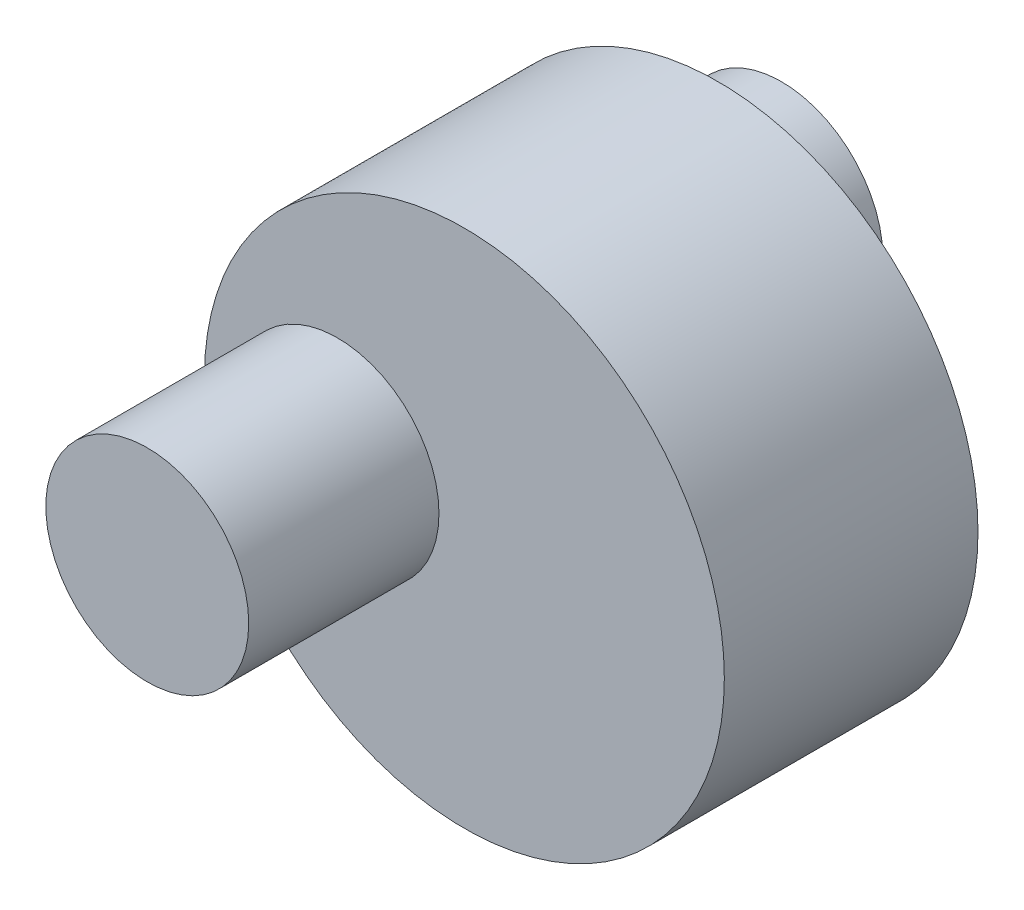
ISO-10303-21;
HEADER;
FILE_DESCRIPTION(('STEP AP214'),'2;1');
FILE_NAME('part.step','',(''),(''),'','','');
FILE_SCHEMA(('AUTOMOTIVE_DESIGN { 1 0 10303 214 1 1 1 1 }'));
ENDSEC;
DATA;
#1=APPLICATION_CONTEXT('core data for automotive mechanical design processes');
#2=APPLICATION_PROTOCOL_DEFINITION('international standard','automotive_design',2000,#1);
#3=PRODUCT_CONTEXT('',#1,'mechanical');
#4=PRODUCT('Part','Part','',(#3));
#5=PRODUCT_RELATED_PRODUCT_CATEGORY('part','',(#4));
#6=PRODUCT_DEFINITION_FORMATION('','',#4);
#7=PRODUCT_DEFINITION_CONTEXT('part definition',#1,'design');
#8=PRODUCT_DEFINITION('design','',#6,#7);
#9=PRODUCT_DEFINITION_SHAPE('','',#8);
#10=(LENGTH_UNIT() NAMED_UNIT(*) SI_UNIT(.MILLI.,.METRE.));
#11=(NAMED_UNIT(*) PLANE_ANGLE_UNIT() SI_UNIT($,.RADIAN.));
#12=(NAMED_UNIT(*) SI_UNIT($,.STERADIAN.) SOLID_ANGLE_UNIT());
#13=UNCERTAINTY_MEASURE_WITH_UNIT(LENGTH_MEASURE(1.E-05),#10,'distance_accuracy_value','');
#14=(GEOMETRIC_REPRESENTATION_CONTEXT(3) GLOBAL_UNCERTAINTY_ASSIGNED_CONTEXT((#13)) GLOBAL_UNIT_ASSIGNED_CONTEXT((#10,
#11,#12)) REPRESENTATION_CONTEXT('',''));
#15=CARTESIAN_POINT('',(0.,0.,0.));
#16=DIRECTION('',(0.,0.,1.));
#17=DIRECTION('',(1.,0.,0.));
#18=AXIS2_PLACEMENT_3D('',#15,#16,#17);
#19=CARTESIAN_POINT('',(0.,0.,25.));
#20=DIRECTION('',(0.,0.,-1.));
#21=DIRECTION('',(-1.,0.,0.));
#22=AXIS2_PLACEMENT_3D('',#19,#20,#21);
#23=CYLINDRICAL_SURFACE('',#22,8.);
#24=CARTESIAN_POINT('',(0.,0.,10.));
#25=DIRECTION('',(0.,0.,1.));
#26=DIRECTION('',(1.,0.,0.));
#27=AXIS2_PLACEMENT_3D('',#24,#25,#26);
#28=CIRCLE('',#27,8.);
#29=CARTESIAN_POINT('',(8.,0.,10.));
#30=VERTEX_POINT('',#29);
#31=EDGE_CURVE('E27',#30,#30,#28,.T.);
#32=ORIENTED_EDGE('',*,*,#31,.T.);
#33=EDGE_LOOP('',(#32));
#34=FACE_BOUND('',#33,.T.);
#35=CARTESIAN_POINT('',(0.,0.,25.));
#36=DIRECTION('',(0.,0.,1.));
#37=DIRECTION('',(1.,0.,0.));
#38=AXIS2_PLACEMENT_3D('',#35,#36,#37);
#39=CIRCLE('',#38,8.);
#40=CARTESIAN_POINT('',(8.,0.,25.));
#41=VERTEX_POINT('',#40);
#42=EDGE_CURVE('E31',#41,#41,#39,.T.);
#43=ORIENTED_EDGE('',*,*,#42,.F.);
#44=EDGE_LOOP('',(#43));
#45=FACE_BOUND('',#44,.T.);
#46=ADVANCED_FACE('F24',(#34,#45),#23,.T.);
#47=CARTESIAN_POINT('',(0.,0.,25.));
#48=DIRECTION('',(0.,0.,1.));
#49=DIRECTION('',(1.,0.,0.));
#50=AXIS2_PLACEMENT_3D('',#47,#48,#49);
#51=PLANE('',#50);
#52=ORIENTED_EDGE('',*,*,#42,.T.);
#53=EDGE_LOOP('',(#52));
#54=FACE_BOUND('',#53,.T.);
#55=ADVANCED_FACE('F60',(#54),#51,.T.);
#56=CARTESIAN_POINT('',(10.,0.,10.));
#57=DIRECTION('',(0.,0.,1.));
#58=DIRECTION('',(1.,0.,0.));
#59=AXIS2_PLACEMENT_3D('',#56,#57,#58);
#60=PLANE('',#59);
#61=CARTESIAN_POINT('',(10.,0.,10.));
#62=DIRECTION('',(0.,0.,1.));
#63=DIRECTION('',(1.,0.,0.));
#64=AXIS2_PLACEMENT_3D('',#61,#62,#63);
#65=CIRCLE('',#64,20.5);
#66=CARTESIAN_POINT('',(30.5,0.,10.));
#67=VERTEX_POINT('',#66);
#68=EDGE_CURVE('E40',#67,#67,#65,.T.);
#69=ORIENTED_EDGE('',*,*,#68,.T.);
#70=EDGE_LOOP('',(#69));
#71=FACE_BOUND('',#70,.T.);
#72=ORIENTED_EDGE('',*,*,#31,.F.);
#73=EDGE_LOOP('',(#72));
#74=FACE_BOUND('',#73,.T.);
#75=ADVANCED_FACE('F51',(#71,#74),#60,.T.);
#76=CARTESIAN_POINT('',(10.,0.,-10.));
#77=DIRECTION('',(0.,0.,1.));
#78=DIRECTION('',(1.,0.,0.));
#79=AXIS2_PLACEMENT_3D('',#76,#77,#78);
#80=PLANE('',#79);
#81=CARTESIAN_POINT('',(10.,0.,-10.));
#82=DIRECTION('',(0.,0.,1.));
#83=DIRECTION('',(1.,0.,0.));
#84=AXIS2_PLACEMENT_3D('',#81,#82,#83);
#85=CIRCLE('',#84,20.5);
#86=CARTESIAN_POINT('',(30.5,0.,-10.));
#87=VERTEX_POINT('',#86);
#88=EDGE_CURVE('E43',#87,#87,#85,.T.);
#89=ORIENTED_EDGE('',*,*,#88,.F.);
#90=EDGE_LOOP('',(#89));
#91=FACE_BOUND('',#90,.T.);
#92=CARTESIAN_POINT('',(0.,0.,-10.));
#93=DIRECTION('',(0.,0.,1.));
#94=DIRECTION('',(1.,0.,0.));
#95=AXIS2_PLACEMENT_3D('',#92,#93,#94);
#96=CIRCLE('',#95,8.);
#97=CARTESIAN_POINT('',(8.,0.,-10.));
#98=VERTEX_POINT('',#97);
#99=EDGE_CURVE('E10',#98,#98,#96,.T.);
#100=ORIENTED_EDGE('',*,*,#99,.T.);
#101=EDGE_LOOP('',(#100));
#102=FACE_BOUND('',#101,.T.);
#103=ADVANCED_FACE('F49',(#91,#102),#80,.F.);
#104=CARTESIAN_POINT('',(10.,0.,10.));
#105=DIRECTION('',(0.,0.,-1.));
#106=DIRECTION('',(-1.,0.,0.));
#107=AXIS2_PLACEMENT_3D('',#104,#105,#106);
#108=CYLINDRICAL_SURFACE('',#107,20.5);
#109=ORIENTED_EDGE('',*,*,#68,.F.);
#110=EDGE_LOOP('',(#109));
#111=FACE_BOUND('',#110,.T.);
#112=ORIENTED_EDGE('',*,*,#88,.T.);
#113=EDGE_LOOP('',(#112));
#114=FACE_BOUND('',#113,.T.);
#115=ADVANCED_FACE('F47',(#111,#114),#108,.T.);
#116=CARTESIAN_POINT('',(0.,0.,-25.));
#117=DIRECTION('',(0.,0.,1.));
#118=DIRECTION('',(1.,0.,0.));
#119=AXIS2_PLACEMENT_3D('',#116,#117,#118);
#120=PLANE('',#119);
#121=CARTESIAN_POINT('',(0.,0.,-25.));
#122=DIRECTION('',(0.,0.,1.));
#123=DIRECTION('',(1.,0.,0.));
#124=AXIS2_PLACEMENT_3D('',#121,#122,#123);
#125=CIRCLE('',#124,8.);
#126=CARTESIAN_POINT('',(8.,0.,-25.));
#127=VERTEX_POINT('',#126);
#128=EDGE_CURVE('E35',#127,#127,#125,.T.);
#129=ORIENTED_EDGE('',*,*,#128,.F.);
#130=EDGE_LOOP('',(#129));
#131=FACE_BOUND('',#130,.T.);
#132=ADVANCED_FACE('F57',(#131),#120,.F.);
#133=ORIENTED_EDGE('',*,*,#128,.T.);
#134=EDGE_LOOP('',(#133));
#135=FACE_BOUND('',#134,.T.);
#136=ORIENTED_EDGE('',*,*,#99,.F.);
#137=EDGE_LOOP('',(#136));
#138=FACE_BOUND('',#137,.T.);
#139=ADVANCED_FACE('F65',(#135,#138),#23,.T.);
#140=CLOSED_SHELL('',(#46,#55,#75,#103,#115,#132,#139));
#141=MANIFOLD_SOLID_BREP('B2',#140);
#142=ADVANCED_BREP_SHAPE_REPRESENTATION('',(#18,#141),#14);
#143=SHAPE_DEFINITION_REPRESENTATION(#9,#142);
ENDSEC;
END-ISO-10303-21;
